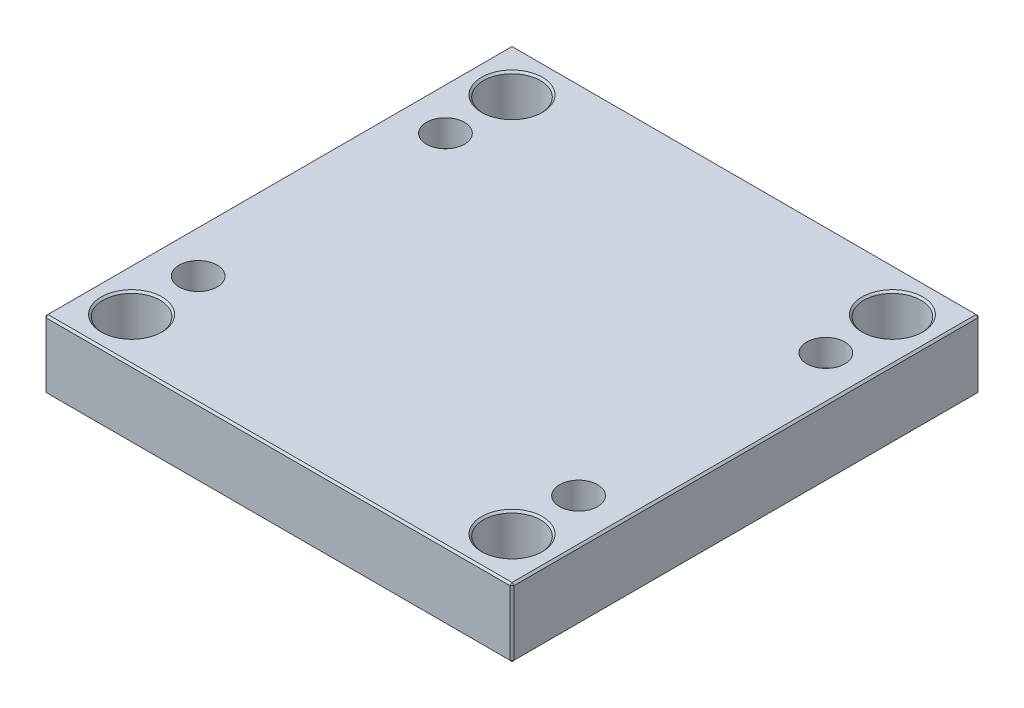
ISO-10303-21;
HEADER;
FILE_DESCRIPTION(('STEP AP214'),'2;1');
FILE_NAME('part.step','',(''),(''),'','','');
FILE_SCHEMA(('AUTOMOTIVE_DESIGN { 1 0 10303 214 1 1 1 1 }'));
ENDSEC;
DATA;
#1=APPLICATION_CONTEXT('core data for automotive mechanical design processes');
#2=APPLICATION_PROTOCOL_DEFINITION('international standard','automotive_design',2000,#1);
#3=PRODUCT_CONTEXT('',#1,'mechanical');
#4=PRODUCT('Part','Part','',(#3));
#5=PRODUCT_RELATED_PRODUCT_CATEGORY('part','',(#4));
#6=PRODUCT_DEFINITION_FORMATION('','',#4);
#7=PRODUCT_DEFINITION_CONTEXT('part definition',#1,'design');
#8=PRODUCT_DEFINITION('design','',#6,#7);
#9=PRODUCT_DEFINITION_SHAPE('','',#8);
#10=(LENGTH_UNIT() NAMED_UNIT(*) SI_UNIT(.MILLI.,.METRE.));
#11=(NAMED_UNIT(*) PLANE_ANGLE_UNIT() SI_UNIT($,.RADIAN.));
#12=(NAMED_UNIT(*) SI_UNIT($,.STERADIAN.) SOLID_ANGLE_UNIT());
#13=UNCERTAINTY_MEASURE_WITH_UNIT(LENGTH_MEASURE(1.E-05),#10,'distance_accuracy_value','');
#14=(GEOMETRIC_REPRESENTATION_CONTEXT(3) GLOBAL_UNCERTAINTY_ASSIGNED_CONTEXT((#13)) GLOBAL_UNIT_ASSIGNED_CONTEXT((#10,
#11,#12)) REPRESENTATION_CONTEXT('',''));
#15=CARTESIAN_POINT('',(0.,0.,0.));
#16=DIRECTION('',(0.,0.,1.));
#17=DIRECTION('',(1.,0.,0.));
#18=AXIS2_PLACEMENT_3D('',#15,#16,#17);
#19=CARTESIAN_POINT('',(-100.,0.,-65.));
#20=DIRECTION('',(0.,1.,0.));
#21=DIRECTION('',(0.,0.,1.));
#22=AXIS2_PLACEMENT_3D('',#19,#20,#21);
#23=CYLINDRICAL_SURFACE('',#22,6.);
#24=CARTESIAN_POINT('',(-100.,0.,-65.));
#25=DIRECTION('',(0.,1.,0.));
#26=DIRECTION('',(0.,0.,1.));
#27=AXIS2_PLACEMENT_3D('',#24,#25,#26);
#28=CIRCLE('',#27,6.);
#29=CARTESIAN_POINT('',(-100.,0.,-59.));
#30=VERTEX_POINT('',#29);
#31=EDGE_CURVE('E150',#30,#30,#28,.T.);
#32=ORIENTED_EDGE('',*,*,#31,.F.);
#33=EDGE_LOOP('',(#32));
#34=FACE_BOUND('',#33,.T.);
#35=CARTESIAN_POINT('',(-100.,22.,-65.));
#36=DIRECTION('',(0.,1.,0.));
#37=DIRECTION('',(0.,0.,1.));
#38=AXIS2_PLACEMENT_3D('',#35,#36,#37);
#39=CIRCLE('',#38,6.);
#40=CARTESIAN_POINT('',(-100.,22.,-59.));
#41=VERTEX_POINT('',#40);
#42=EDGE_CURVE('E20',#41,#41,#39,.F.);
#43=ORIENTED_EDGE('',*,*,#42,.F.);
#44=EDGE_LOOP('',(#43));
#45=FACE_BOUND('',#44,.T.);
#46=ADVANCED_FACE('F16',(#34,#45),#23,.F.);
#47=CARTESIAN_POINT('',(100.,0.,-65.));
#48=DIRECTION('',(0.,1.,0.));
#49=DIRECTION('',(0.,0.,1.));
#50=AXIS2_PLACEMENT_3D('',#47,#48,#49);
#51=CYLINDRICAL_SURFACE('',#50,6.);
#52=CARTESIAN_POINT('',(100.,0.,-65.));
#53=DIRECTION('',(0.,1.,0.));
#54=DIRECTION('',(0.,0.,1.));
#55=AXIS2_PLACEMENT_3D('',#52,#53,#54);
#56=CIRCLE('',#55,6.);
#57=CARTESIAN_POINT('',(100.,0.,-59.));
#58=VERTEX_POINT('',#57);
#59=EDGE_CURVE('E307',#58,#58,#56,.T.);
#60=ORIENTED_EDGE('',*,*,#59,.F.);
#61=EDGE_LOOP('',(#60));
#62=FACE_BOUND('',#61,.T.);
#63=CARTESIAN_POINT('',(100.,22.,-65.));
#64=DIRECTION('',(0.,1.,0.));
#65=DIRECTION('',(0.,0.,1.));
#66=AXIS2_PLACEMENT_3D('',#63,#64,#65);
#67=CIRCLE('',#66,6.);
#68=CARTESIAN_POINT('',(100.,22.,-59.));
#69=VERTEX_POINT('',#68);
#70=EDGE_CURVE('E294',#69,#69,#67,.F.);
#71=ORIENTED_EDGE('',*,*,#70,.F.);
#72=EDGE_LOOP('',(#71));
#73=FACE_BOUND('',#72,.T.);
#74=ADVANCED_FACE('F473',(#62,#73),#51,.F.);
#75=CARTESIAN_POINT('',(100.,0.,65.));
#76=DIRECTION('',(0.,1.,0.));
#77=DIRECTION('',(0.,0.,1.));
#78=AXIS2_PLACEMENT_3D('',#75,#76,#77);
#79=CYLINDRICAL_SURFACE('',#78,6.);
#80=CARTESIAN_POINT('',(100.,0.,65.));
#81=DIRECTION('',(0.,1.,0.));
#82=DIRECTION('',(0.,0.,1.));
#83=AXIS2_PLACEMENT_3D('',#80,#81,#82);
#84=CIRCLE('',#83,6.);
#85=CARTESIAN_POINT('',(100.,0.,71.));
#86=VERTEX_POINT('',#85);
#87=EDGE_CURVE('E303',#86,#86,#84,.T.);
#88=ORIENTED_EDGE('',*,*,#87,.F.);
#89=EDGE_LOOP('',(#88));
#90=FACE_BOUND('',#89,.T.);
#91=CARTESIAN_POINT('',(100.,22.,65.));
#92=DIRECTION('',(0.,1.,0.));
#93=DIRECTION('',(0.,0.,1.));
#94=AXIS2_PLACEMENT_3D('',#91,#92,#93);
#95=CIRCLE('',#94,6.);
#96=CARTESIAN_POINT('',(100.,22.,71.));
#97=VERTEX_POINT('',#96);
#98=EDGE_CURVE('E291',#97,#97,#95,.F.);
#99=ORIENTED_EDGE('',*,*,#98,.F.);
#100=EDGE_LOOP('',(#99));
#101=FACE_BOUND('',#100,.T.);
#102=ADVANCED_FACE('F480',(#90,#101),#79,.F.);
#103=CARTESIAN_POINT('',(-100.,0.,65.));
#104=DIRECTION('',(0.,1.,0.));
#105=DIRECTION('',(0.,0.,1.));
#106=AXIS2_PLACEMENT_3D('',#103,#104,#105);
#107=CYLINDRICAL_SURFACE('',#106,6.);
#108=CARTESIAN_POINT('',(-100.,0.,65.));
#109=DIRECTION('',(0.,1.,0.));
#110=DIRECTION('',(0.,0.,1.));
#111=AXIS2_PLACEMENT_3D('',#108,#109,#110);
#112=CIRCLE('',#111,6.);
#113=CARTESIAN_POINT('',(-100.,0.,71.));
#114=VERTEX_POINT('',#113);
#115=EDGE_CURVE('E299',#114,#114,#112,.T.);
#116=ORIENTED_EDGE('',*,*,#115,.F.);
#117=EDGE_LOOP('',(#116));
#118=FACE_BOUND('',#117,.T.);
#119=CARTESIAN_POINT('',(-100.,22.,65.));
#120=DIRECTION('',(0.,1.,0.));
#121=DIRECTION('',(0.,0.,1.));
#122=AXIS2_PLACEMENT_3D('',#119,#120,#121);
#123=CIRCLE('',#122,6.);
#124=CARTESIAN_POINT('',(-100.,22.,71.));
#125=VERTEX_POINT('',#124);
#126=EDGE_CURVE('E288',#125,#125,#123,.F.);
#127=ORIENTED_EDGE('',*,*,#126,.F.);
#128=EDGE_LOOP('',(#127));
#129=FACE_BOUND('',#128,.T.);
#130=ADVANCED_FACE('F485',(#118,#129),#107,.F.);
#131=CARTESIAN_POINT('',(-123.,36.,123.));
#132=DIRECTION('',(1.,0.,0.));
#133=DIRECTION('',(0.,0.,-1.));
#134=AXIS2_PLACEMENT_3D('',#131,#132,#133);
#135=PLANE('',#134);
#136=DIRECTION('',(0.,-1.,0.));
#137=VECTOR('',#136,1.);
#138=CARTESIAN_POINT('',(-123.,36.,-122.));
#139=LINE('',#138,#137);
#140=CARTESIAN_POINT('',(-123.,35.,-122.));
#141=VERTEX_POINT('',#140);
#142=CARTESIAN_POINT('',(-123.,1.,-122.));
#143=VERTEX_POINT('',#142);
#144=EDGE_CURVE('E118',#141,#143,#139,.T.);
#145=ORIENTED_EDGE('',*,*,#144,.T.);
#146=DIRECTION('',(0.,0.,1.));
#147=VECTOR('',#146,1.);
#148=CARTESIAN_POINT('',(-123.,1.,123.));
#149=LINE('',#148,#147);
#150=CARTESIAN_POINT('',(-123.,1.,122.));
#151=VERTEX_POINT('',#150);
#152=EDGE_CURVE('E114',#143,#151,#149,.T.);
#153=ORIENTED_EDGE('',*,*,#152,.T.);
#154=DIRECTION('',(0.,1.,0.));
#155=VECTOR('',#154,1.);
#156=CARTESIAN_POINT('',(-123.,36.,122.));
#157=LINE('',#156,#155);
#158=CARTESIAN_POINT('',(-123.,35.,122.));
#159=VERTEX_POINT('',#158);
#160=EDGE_CURVE('E106',#151,#159,#157,.T.);
#161=ORIENTED_EDGE('',*,*,#160,.T.);
#162=DIRECTION('',(0.,0.,-1.));
#163=VECTOR('',#162,1.);
#164=CARTESIAN_POINT('',(-123.,35.,-123.));
#165=LINE('',#164,#163);
#166=EDGE_CURVE('E111',#159,#141,#165,.T.);
#167=ORIENTED_EDGE('',*,*,#166,.T.);
#168=EDGE_LOOP('',(#145,#153,#161,#167));
#169=FACE_BOUND('',#168,.T.);
#170=ADVANCED_FACE('F109',(#169),#135,.F.);
#171=CARTESIAN_POINT('',(123.,36.,123.));
#172=DIRECTION('',(0.,0.,-1.));
#173=DIRECTION('',(-1.,0.,0.));
#174=AXIS2_PLACEMENT_3D('',#171,#172,#173);
#175=PLANE('',#174);
#176=DIRECTION('',(-1.,0.,0.));
#177=VECTOR('',#176,1.);
#178=CARTESIAN_POINT('',(-123.,35.,123.));
#179=LINE('',#178,#177);
#180=CARTESIAN_POINT('',(122.,35.,123.));
#181=VERTEX_POINT('',#180);
#182=CARTESIAN_POINT('',(-122.,35.,123.));
#183=VERTEX_POINT('',#182);
#184=EDGE_CURVE('E173',#181,#183,#179,.T.);
#185=ORIENTED_EDGE('',*,*,#184,.T.);
#186=DIRECTION('',(0.,-1.,0.));
#187=VECTOR('',#186,1.);
#188=CARTESIAN_POINT('',(-122.,36.,123.));
#189=LINE('',#188,#187);
#190=CARTESIAN_POINT('',(-122.,1.,123.));
#191=VERTEX_POINT('',#190);
#192=EDGE_CURVE('E126',#183,#191,#189,.T.);
#193=ORIENTED_EDGE('',*,*,#192,.T.);
#194=DIRECTION('',(1.,0.,0.));
#195=VECTOR('',#194,1.);
#196=CARTESIAN_POINT('',(123.,1.,123.));
#197=LINE('',#196,#195);
#198=CARTESIAN_POINT('',(122.,1.,123.));
#199=VERTEX_POINT('',#198);
#200=EDGE_CURVE('E177',#191,#199,#197,.T.);
#201=ORIENTED_EDGE('',*,*,#200,.T.);
#202=DIRECTION('',(0.,1.,0.));
#203=VECTOR('',#202,1.);
#204=CARTESIAN_POINT('',(122.,36.,123.));
#205=LINE('',#204,#203);
#206=EDGE_CURVE('E175',#199,#181,#205,.T.);
#207=ORIENTED_EDGE('',*,*,#206,.T.);
#208=EDGE_LOOP('',(#185,#193,#201,#207));
#209=FACE_BOUND('',#208,.T.);
#210=ADVANCED_FACE('F438',(#209),#175,.F.);
#211=CARTESIAN_POINT('',(123.,36.,123.));
#212=DIRECTION('',(-1.,0.,0.));
#213=DIRECTION('',(0.,0.,1.));
#214=AXIS2_PLACEMENT_3D('',#211,#212,#213);
#215=PLANE('',#214);
#216=DIRECTION('',(0.,0.,-1.));
#217=VECTOR('',#216,1.);
#218=CARTESIAN_POINT('',(123.,1.,123.));
#219=LINE('',#218,#217);
#220=CARTESIAN_POINT('',(123.,1.,122.));
#221=VERTEX_POINT('',#220);
#222=CARTESIAN_POINT('',(123.,1.,-122.));
#223=VERTEX_POINT('',#222);
#224=EDGE_CURVE('E168',#221,#223,#219,.T.);
#225=ORIENTED_EDGE('',*,*,#224,.T.);
#226=DIRECTION('',(0.,1.,0.));
#227=VECTOR('',#226,1.);
#228=CARTESIAN_POINT('',(123.,36.,-122.));
#229=LINE('',#228,#227);
#230=CARTESIAN_POINT('',(123.,35.,-122.));
#231=VERTEX_POINT('',#230);
#232=EDGE_CURVE('E170',#223,#231,#229,.T.);
#233=ORIENTED_EDGE('',*,*,#232,.T.);
#234=DIRECTION('',(0.,0.,1.));
#235=VECTOR('',#234,1.);
#236=CARTESIAN_POINT('',(123.,35.,123.));
#237=LINE('',#236,#235);
#238=CARTESIAN_POINT('',(123.,35.,122.));
#239=VERTEX_POINT('',#238);
#240=EDGE_CURVE('E164',#231,#239,#237,.T.);
#241=ORIENTED_EDGE('',*,*,#240,.T.);
#242=DIRECTION('',(0.,-1.,0.));
#243=VECTOR('',#242,1.);
#244=CARTESIAN_POINT('',(123.,36.,122.));
#245=LINE('',#244,#243);
#246=EDGE_CURVE('E166',#239,#221,#245,.T.);
#247=ORIENTED_EDGE('',*,*,#246,.T.);
#248=EDGE_LOOP('',(#225,#233,#241,#247));
#249=FACE_BOUND('',#248,.T.);
#250=ADVANCED_FACE('F431',(#249),#215,.F.);
#251=CARTESIAN_POINT('',(123.,36.,-123.));
#252=DIRECTION('',(0.,0.,1.));
#253=DIRECTION('',(1.,0.,0.));
#254=AXIS2_PLACEMENT_3D('',#251,#252,#253);
#255=PLANE('',#254);
#256=DIRECTION('',(0.,-1.,0.));
#257=VECTOR('',#256,1.);
#258=CARTESIAN_POINT('',(122.,36.,-123.));
#259=LINE('',#258,#257);
#260=CARTESIAN_POINT('',(122.,35.,-123.));
#261=VERTEX_POINT('',#260);
#262=CARTESIAN_POINT('',(122.,1.,-123.));
#263=VERTEX_POINT('',#262);
#264=EDGE_CURVE('E157',#261,#263,#259,.T.);
#265=ORIENTED_EDGE('',*,*,#264,.T.);
#266=DIRECTION('',(-1.,0.,0.));
#267=VECTOR('',#266,1.);
#268=CARTESIAN_POINT('',(123.,1.,-123.));
#269=LINE('',#268,#267);
#270=CARTESIAN_POINT('',(-122.,1.,-123.));
#271=VERTEX_POINT('',#270);
#272=EDGE_CURVE('E162',#263,#271,#269,.T.);
#273=ORIENTED_EDGE('',*,*,#272,.T.);
#274=DIRECTION('',(0.,1.,0.));
#275=VECTOR('',#274,1.);
#276=CARTESIAN_POINT('',(-122.,36.,-123.));
#277=LINE('',#276,#275);
#278=CARTESIAN_POINT('',(-122.,35.,-123.));
#279=VERTEX_POINT('',#278);
#280=EDGE_CURVE('E159',#271,#279,#277,.T.);
#281=ORIENTED_EDGE('',*,*,#280,.T.);
#282=DIRECTION('',(1.,0.,0.));
#283=VECTOR('',#282,1.);
#284=CARTESIAN_POINT('',(123.,35.,-123.));
#285=LINE('',#284,#283);
#286=EDGE_CURVE('E155',#279,#261,#285,.T.);
#287=ORIENTED_EDGE('',*,*,#286,.T.);
#288=EDGE_LOOP('',(#265,#273,#281,#287));
#289=FACE_BOUND('',#288,.T.);
#290=ADVANCED_FACE('F349',(#289),#255,.F.);
#291=CARTESIAN_POINT('',(0.,36.,0.));
#292=DIRECTION('',(0.,1.,0.));
#293=DIRECTION('',(0.,0.,1.));
#294=AXIS2_PLACEMENT_3D('',#291,#292,#293);
#295=PLANE('',#294);
#296=CARTESIAN_POINT('',(-100.,36.,65.));
#297=DIRECTION('',(0.,1.,0.));
#298=DIRECTION('',(0.,0.,1.));
#299=AXIS2_PLACEMENT_3D('',#296,#297,#298);
#300=CIRCLE('',#299,10.);
#301=CARTESIAN_POINT('',(-100.,36.,75.));
#302=VERTEX_POINT('',#301);
#303=EDGE_CURVE('E318',#302,#302,#300,.T.);
#304=ORIENTED_EDGE('',*,*,#303,.F.);
#305=EDGE_LOOP('',(#304));
#306=FACE_BOUND('',#305,.T.);
#307=CARTESIAN_POINT('',(100.,36.,65.));
#308=DIRECTION('',(0.,1.,0.));
#309=DIRECTION('',(0.,0.,1.));
#310=AXIS2_PLACEMENT_3D('',#307,#308,#309);
#311=CIRCLE('',#310,10.);
#312=CARTESIAN_POINT('',(100.,36.,75.));
#313=VERTEX_POINT('',#312);
#314=EDGE_CURVE('E324',#313,#313,#311,.T.);
#315=ORIENTED_EDGE('',*,*,#314,.F.);
#316=EDGE_LOOP('',(#315));
#317=FACE_BOUND('',#316,.T.);
#318=CARTESIAN_POINT('',(100.,36.,-65.));
#319=DIRECTION('',(0.,1.,0.));
#320=DIRECTION('',(0.,0.,1.));
#321=AXIS2_PLACEMENT_3D('',#318,#319,#320);
#322=CIRCLE('',#321,10.);
#323=CARTESIAN_POINT('',(100.,36.,-55.));
#324=VERTEX_POINT('',#323);
#325=EDGE_CURVE('E330',#324,#324,#322,.T.);
#326=ORIENTED_EDGE('',*,*,#325,.F.);
#327=EDGE_LOOP('',(#326));
#328=FACE_BOUND('',#327,.T.);
#329=CARTESIAN_POINT('',(-100.,36.,-65.));
#330=DIRECTION('',(0.,1.,0.));
#331=DIRECTION('',(0.,0.,1.));
#332=AXIS2_PLACEMENT_3D('',#329,#330,#331);
#333=CIRCLE('',#332,10.);
#334=CARTESIAN_POINT('',(-100.,36.,-55.));
#335=VERTEX_POINT('',#334);
#336=EDGE_CURVE('E312',#335,#335,#333,.T.);
#337=ORIENTED_EDGE('',*,*,#336,.F.);
#338=EDGE_LOOP('',(#337));
#339=FACE_BOUND('',#338,.T.);
#340=CARTESIAN_POINT('',(-100.,36.,100.));
#341=DIRECTION('',(0.,1.,0.));
#342=DIRECTION('',(0.,0.,1.));
#343=AXIS2_PLACEMENT_3D('',#340,#341,#342);
#344=CIRCLE('',#343,16.);
#345=CARTESIAN_POINT('',(-100.,36.,116.));
#346=VERTEX_POINT('',#345);
#347=EDGE_CURVE('E259',#346,#346,#344,.F.);
#348=ORIENTED_EDGE('',*,*,#347,.T.);
#349=EDGE_LOOP('',(#348));
#350=FACE_BOUND('',#349,.T.);
#351=CARTESIAN_POINT('',(100.,36.,100.));
#352=DIRECTION('',(0.,1.,0.));
#353=DIRECTION('',(0.,0.,1.));
#354=AXIS2_PLACEMENT_3D('',#351,#352,#353);
#355=CIRCLE('',#354,16.);
#356=CARTESIAN_POINT('',(100.,36.,116.));
#357=VERTEX_POINT('',#356);
#358=EDGE_CURVE('E256',#357,#357,#355,.F.);
#359=ORIENTED_EDGE('',*,*,#358,.T.);
#360=EDGE_LOOP('',(#359));
#361=FACE_BOUND('',#360,.T.);
#362=CARTESIAN_POINT('',(100.,36.,-100.));
#363=DIRECTION('',(0.,1.,0.));
#364=DIRECTION('',(0.,0.,1.));
#365=AXIS2_PLACEMENT_3D('',#362,#363,#364);
#366=CIRCLE('',#365,16.);
#367=CARTESIAN_POINT('',(100.,36.,-84.));
#368=VERTEX_POINT('',#367);
#369=EDGE_CURVE('E253',#368,#368,#366,.F.);
#370=ORIENTED_EDGE('',*,*,#369,.T.);
#371=EDGE_LOOP('',(#370));
#372=FACE_BOUND('',#371,.T.);
#373=CARTESIAN_POINT('',(-100.,36.,-100.));
#374=DIRECTION('',(0.,1.,0.));
#375=DIRECTION('',(0.,0.,1.));
#376=AXIS2_PLACEMENT_3D('',#373,#374,#375);
#377=CIRCLE('',#376,16.);
#378=CARTESIAN_POINT('',(-100.,36.,-84.));
#379=VERTEX_POINT('',#378);
#380=EDGE_CURVE('E250',#379,#379,#377,.F.);
#381=ORIENTED_EDGE('',*,*,#380,.T.);
#382=EDGE_LOOP('',(#381));
#383=FACE_BOUND('',#382,.T.);
#384=DIRECTION('',(0.,0.,-1.));
#385=VECTOR('',#384,1.);
#386=CARTESIAN_POINT('',(122.,36.,-123.));
#387=LINE('',#386,#385);
#388=CARTESIAN_POINT('',(122.,36.,122.));
#389=VERTEX_POINT('',#388);
#390=CARTESIAN_POINT('',(122.,36.,-122.));
#391=VERTEX_POINT('',#390);
#392=EDGE_CURVE('E33',#389,#391,#387,.T.);
#393=ORIENTED_EDGE('',*,*,#392,.T.);
#394=DIRECTION('',(-1.,0.,0.));
#395=VECTOR('',#394,1.);
#396=CARTESIAN_POINT('',(-123.,36.,-122.));
#397=LINE('',#396,#395);
#398=CARTESIAN_POINT('',(-122.,36.,-122.));
#399=VERTEX_POINT('',#398);
#400=EDGE_CURVE('E193',#391,#399,#397,.T.);
#401=ORIENTED_EDGE('',*,*,#400,.T.);
#402=DIRECTION('',(0.,0.,1.));
#403=VECTOR('',#402,1.);
#404=CARTESIAN_POINT('',(-122.,36.,123.));
#405=LINE('',#404,#403);
#406=CARTESIAN_POINT('',(-122.,36.,122.));
#407=VERTEX_POINT('',#406);
#408=EDGE_CURVE('E189',#399,#407,#405,.T.);
#409=ORIENTED_EDGE('',*,*,#408,.T.);
#410=DIRECTION('',(1.,0.,0.));
#411=VECTOR('',#410,1.);
#412=CARTESIAN_POINT('',(123.,36.,122.));
#413=LINE('',#412,#411);
#414=EDGE_CURVE('E38',#407,#389,#413,.T.);
#415=ORIENTED_EDGE('',*,*,#414,.T.);
#416=EDGE_LOOP('',(#393,#401,#409,#415));
#417=FACE_BOUND('',#416,.T.);
#418=ADVANCED_FACE('F345',(#306,#317,#328,#339,#350,#361,#372,#383,#417),#295,.T.);
#419=CARTESIAN_POINT('',(0.,0.,0.));
#420=DIRECTION('',(0.,1.,0.));
#421=DIRECTION('',(0.,0.,1.));
#422=AXIS2_PLACEMENT_3D('',#419,#420,#421);
#423=PLANE('',#422);
#424=CARTESIAN_POINT('',(-100.,0.,100.));
#425=DIRECTION('',(0.,1.,0.));
#426=DIRECTION('',(0.,0.,1.));
#427=AXIS2_PLACEMENT_3D('',#424,#425,#426);
#428=CIRCLE('',#427,16.);
#429=CARTESIAN_POINT('',(-100.,0.,116.));
#430=VERTEX_POINT('',#429);
#431=EDGE_CURVE('E271',#430,#430,#428,.T.);
#432=ORIENTED_EDGE('',*,*,#431,.T.);
#433=EDGE_LOOP('',(#432));
#434=FACE_BOUND('',#433,.T.);
#435=CARTESIAN_POINT('',(100.,0.,100.));
#436=DIRECTION('',(0.,1.,0.));
#437=DIRECTION('',(0.,0.,1.));
#438=AXIS2_PLACEMENT_3D('',#435,#436,#437);
#439=CIRCLE('',#438,16.);
#440=CARTESIAN_POINT('',(100.,0.,116.));
#441=VERTEX_POINT('',#440);
#442=EDGE_CURVE('E268',#441,#441,#439,.T.);
#443=ORIENTED_EDGE('',*,*,#442,.T.);
#444=EDGE_LOOP('',(#443));
#445=FACE_BOUND('',#444,.T.);
#446=CARTESIAN_POINT('',(100.,0.,-100.));
#447=DIRECTION('',(0.,1.,0.));
#448=DIRECTION('',(0.,0.,1.));
#449=AXIS2_PLACEMENT_3D('',#446,#447,#448);
#450=CIRCLE('',#449,16.);
#451=CARTESIAN_POINT('',(100.,0.,-84.));
#452=VERTEX_POINT('',#451);
#453=EDGE_CURVE('E265',#452,#452,#450,.T.);
#454=ORIENTED_EDGE('',*,*,#453,.T.);
#455=EDGE_LOOP('',(#454));
#456=FACE_BOUND('',#455,.T.);
#457=CARTESIAN_POINT('',(-100.,0.,-100.));
#458=DIRECTION('',(0.,1.,0.));
#459=DIRECTION('',(0.,0.,1.));
#460=AXIS2_PLACEMENT_3D('',#457,#458,#459);
#461=CIRCLE('',#460,16.);
#462=CARTESIAN_POINT('',(-100.,0.,-84.));
#463=VERTEX_POINT('',#462);
#464=EDGE_CURVE('E262',#463,#463,#461,.T.);
#465=ORIENTED_EDGE('',*,*,#464,.T.);
#466=EDGE_LOOP('',(#465));
#467=FACE_BOUND('',#466,.T.);
#468=ORIENTED_EDGE('',*,*,#115,.T.);
#469=EDGE_LOOP('',(#468));
#470=FACE_BOUND('',#469,.T.);
#471=ORIENTED_EDGE('',*,*,#87,.T.);
#472=EDGE_LOOP('',(#471));
#473=FACE_BOUND('',#472,.T.);
#474=ORIENTED_EDGE('',*,*,#59,.T.);
#475=EDGE_LOOP('',(#474));
#476=FACE_BOUND('',#475,.T.);
#477=ORIENTED_EDGE('',*,*,#31,.T.);
#478=EDGE_LOOP('',(#477));
#479=FACE_BOUND('',#478,.T.);
#480=DIRECTION('',(0.,0.,1.));
#481=VECTOR('',#480,1.);
#482=CARTESIAN_POINT('',(122.,0.,0.));
#483=LINE('',#482,#481);
#484=CARTESIAN_POINT('',(122.,0.,-122.));
#485=VERTEX_POINT('',#484);
#486=CARTESIAN_POINT('',(122.,0.,122.));
#487=VERTEX_POINT('',#486);
#488=EDGE_CURVE('E180',#485,#487,#483,.T.);
#489=ORIENTED_EDGE('',*,*,#488,.T.);
#490=DIRECTION('',(-1.,0.,0.));
#491=VECTOR('',#490,1.);
#492=CARTESIAN_POINT('',(0.,0.,122.));
#493=LINE('',#492,#491);
#494=CARTESIAN_POINT('',(-122.,0.,122.));
#495=VERTEX_POINT('',#494);
#496=EDGE_CURVE('E186',#487,#495,#493,.T.);
#497=ORIENTED_EDGE('',*,*,#496,.T.);
#498=DIRECTION('',(0.,0.,-1.));
#499=VECTOR('',#498,1.);
#500=CARTESIAN_POINT('',(-122.,0.,0.));
#501=LINE('',#500,#499);
#502=CARTESIAN_POINT('',(-122.,0.,-122.));
#503=VERTEX_POINT('',#502);
#504=EDGE_CURVE('E184',#495,#503,#501,.T.);
#505=ORIENTED_EDGE('',*,*,#504,.T.);
#506=DIRECTION('',(1.,0.,0.));
#507=VECTOR('',#506,1.);
#508=CARTESIAN_POINT('',(0.,0.,-122.));
#509=LINE('',#508,#507);
#510=EDGE_CURVE('E182',#503,#485,#509,.T.);
#511=ORIENTED_EDGE('',*,*,#510,.T.);
#512=EDGE_LOOP('',(#489,#497,#505,#511));
#513=FACE_BOUND('',#512,.T.);
#514=ADVANCED_FACE('F348',(#434,#445,#456,#467,#470,#473,#476,#479,#513),#423,.F.);
#515=CARTESIAN_POINT('',(123.,36.,122.));
#516=DIRECTION('',(-0.707106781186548,0.,-0.707106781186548));
#517=DIRECTION('',(0.,-1.,0.));
#518=AXIS2_PLACEMENT_3D('',#515,#516,#517);
#519=PLANE('',#518);
#520=DIRECTION('',(-0.707106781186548,0.,0.707106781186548));
#521=VECTOR('',#520,1.);
#522=CARTESIAN_POINT('',(122.,35.,123.));
#523=LINE('',#522,#521);
#524=EDGE_CURVE('E144',#181,#239,#523,.F.);
#525=ORIENTED_EDGE('',*,*,#524,.F.);
#526=ORIENTED_EDGE('',*,*,#206,.F.);
#527=DIRECTION('',(0.707106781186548,0.,-0.707106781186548));
#528=VECTOR('',#527,1.);
#529=CARTESIAN_POINT('',(122.,1.,123.));
#530=LINE('',#529,#528);
#531=EDGE_CURVE('E147',#221,#199,#530,.F.);
#532=ORIENTED_EDGE('',*,*,#531,.F.);
#533=ORIENTED_EDGE('',*,*,#246,.F.);
#534=EDGE_LOOP('',(#525,#526,#532,#533));
#535=FACE_BOUND('',#534,.T.);
#536=ADVANCED_FACE('F382',(#535),#519,.F.);
#537=CARTESIAN_POINT('',(122.,35.,123.));
#538=DIRECTION('',(0.577350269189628,0.57735026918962,0.577350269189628));
#539=DIRECTION('',(0.707106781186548,0.,-0.707106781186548));
#540=AXIS2_PLACEMENT_3D('',#537,#538,#539);
#541=PLANE('',#540);
#542=DIRECTION('',(0.,-0.70710678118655,0.707106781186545));
#543=VECTOR('',#542,1.);
#544=CARTESIAN_POINT('',(122.,35.,123.));
#545=LINE('',#544,#543);
#546=EDGE_CURVE('E238',#181,#389,#545,.F.);
#547=ORIENTED_EDGE('',*,*,#546,.F.);
#548=ORIENTED_EDGE('',*,*,#524,.T.);
#549=DIRECTION('',(-0.707106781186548,0.707106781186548,0.));
#550=VECTOR('',#549,1.);
#551=CARTESIAN_POINT('',(122.5,35.5,122.));
#552=LINE('',#551,#550);
#553=EDGE_CURVE('E240',#389,#239,#552,.F.);
#554=ORIENTED_EDGE('',*,*,#553,.F.);
#555=EDGE_LOOP('',(#547,#548,#554));
#556=FACE_BOUND('',#555,.T.);
#557=ADVANCED_FACE('F444',(#556),#541,.T.);
#558=CARTESIAN_POINT('',(122.,1.,123.));
#559=DIRECTION('',(0.577350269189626,-0.577350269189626,0.577350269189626));
#560=DIRECTION('',(0.707106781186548,0.,-0.707106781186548));
#561=AXIS2_PLACEMENT_3D('',#558,#559,#560);
#562=PLANE('',#561);
#563=DIRECTION('',(-0.707106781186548,-0.707106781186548,0.));
#564=VECTOR('',#563,1.);
#565=CARTESIAN_POINT('',(122.5,0.5,122.));
#566=LINE('',#565,#564);
#567=EDGE_CURVE('E232',#221,#487,#566,.T.);
#568=ORIENTED_EDGE('',*,*,#567,.F.);
#569=ORIENTED_EDGE('',*,*,#531,.T.);
#570=DIRECTION('',(0.,0.70710678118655,0.707106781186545));
#571=VECTOR('',#570,1.);
#572=CARTESIAN_POINT('',(122.,1.,123.));
#573=LINE('',#572,#571);
#574=EDGE_CURVE('E235',#487,#199,#573,.T.);
#575=ORIENTED_EDGE('',*,*,#574,.F.);
#576=EDGE_LOOP('',(#568,#569,#575));
#577=FACE_BOUND('',#576,.T.);
#578=ADVANCED_FACE('F403',(#577),#562,.T.);
#579=CARTESIAN_POINT('',(122.,36.,0.));
#580=DIRECTION('',(0.707106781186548,0.707106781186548,0.));
#581=DIRECTION('',(0.,0.,1.));
#582=AXIS2_PLACEMENT_3D('',#579,#580,#581);
#583=PLANE('',#582);
#584=ORIENTED_EDGE('',*,*,#553,.T.);
#585=ORIENTED_EDGE('',*,*,#240,.F.);
#586=DIRECTION('',(0.707106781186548,-0.707106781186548,0.));
#587=VECTOR('',#586,1.);
#588=CARTESIAN_POINT('',(123.,35.,-122.));
#589=LINE('',#588,#587);
#590=EDGE_CURVE('E227',#391,#231,#589,.T.);
#591=ORIENTED_EDGE('',*,*,#590,.F.);
#592=ORIENTED_EDGE('',*,*,#392,.F.);
#593=EDGE_LOOP('',(#584,#585,#591,#592));
#594=FACE_BOUND('',#593,.T.);
#595=ADVANCED_FACE('F446',(#594),#583,.T.);
#596=CARTESIAN_POINT('',(0.,36.,122.));
#597=DIRECTION('',(0.,0.707106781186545,0.70710678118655));
#598=DIRECTION('',(-1.,0.,0.));
#599=AXIS2_PLACEMENT_3D('',#596,#597,#598);
#600=PLANE('',#599);
#601=ORIENTED_EDGE('',*,*,#546,.T.);
#602=ORIENTED_EDGE('',*,*,#414,.F.);
#603=DIRECTION('',(0.,0.70710678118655,-0.707106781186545));
#604=VECTOR('',#603,1.);
#605=CARTESIAN_POINT('',(-122.,35.5,122.5));
#606=LINE('',#605,#604);
#607=EDGE_CURVE('E130',#183,#407,#606,.T.);
#608=ORIENTED_EDGE('',*,*,#607,.F.);
#609=ORIENTED_EDGE('',*,*,#184,.F.);
#610=EDGE_LOOP('',(#601,#602,#608,#609));
#611=FACE_BOUND('',#610,.T.);
#612=ADVANCED_FACE('F441',(#611),#600,.T.);
#613=CARTESIAN_POINT('',(-122.,36.,123.));
#614=DIRECTION('',(0.707106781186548,0.,-0.707106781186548));
#615=DIRECTION('',(0.,-1.,0.));
#616=AXIS2_PLACEMENT_3D('',#613,#614,#615);
#617=PLANE('',#616);
#618=DIRECTION('',(0.707106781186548,0.,0.707106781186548));
#619=VECTOR('',#618,1.);
#620=CARTESIAN_POINT('',(-122.,1.,123.));
#621=LINE('',#620,#619);
#622=EDGE_CURVE('E131',#191,#151,#621,.F.);
#623=ORIENTED_EDGE('',*,*,#622,.F.);
#624=ORIENTED_EDGE('',*,*,#192,.F.);
#625=DIRECTION('',(-0.707106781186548,0.,-0.707106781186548));
#626=VECTOR('',#625,1.);
#627=CARTESIAN_POINT('',(-123.,35.,122.));
#628=LINE('',#627,#626);
#629=EDGE_CURVE('E122',#159,#183,#628,.F.);
#630=ORIENTED_EDGE('',*,*,#629,.F.);
#631=ORIENTED_EDGE('',*,*,#160,.F.);
#632=EDGE_LOOP('',(#623,#624,#630,#631));
#633=FACE_BOUND('',#632,.T.);
#634=ADVANCED_FACE('F124',(#633),#617,.F.);
#635=CARTESIAN_POINT('',(123.,1.,123.));
#636=DIRECTION('',(0.,0.707106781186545,-0.70710678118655));
#637=DIRECTION('',(1.,0.,0.));
#638=AXIS2_PLACEMENT_3D('',#635,#636,#637);
#639=PLANE('',#638);
#640=ORIENTED_EDGE('',*,*,#574,.T.);
#641=ORIENTED_EDGE('',*,*,#200,.F.);
#642=DIRECTION('',(0.,-0.70710678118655,-0.707106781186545));
#643=VECTOR('',#642,1.);
#644=CARTESIAN_POINT('',(-122.,1.,123.));
#645=LINE('',#644,#643);
#646=EDGE_CURVE('E223',#495,#191,#645,.F.);
#647=ORIENTED_EDGE('',*,*,#646,.F.);
#648=ORIENTED_EDGE('',*,*,#496,.F.);
#649=EDGE_LOOP('',(#640,#641,#647,#648));
#650=FACE_BOUND('',#649,.T.);
#651=ADVANCED_FACE('F408',(#650),#639,.F.);
#652=CARTESIAN_POINT('',(123.,1.,123.));
#653=DIRECTION('',(-0.707106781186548,0.707106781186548,0.));
#654=DIRECTION('',(0.,0.,-1.));
#655=AXIS2_PLACEMENT_3D('',#652,#653,#654);
#656=PLANE('',#655);
#657=ORIENTED_EDGE('',*,*,#567,.T.);
#658=ORIENTED_EDGE('',*,*,#488,.F.);
#659=DIRECTION('',(0.707106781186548,0.707106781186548,0.));
#660=VECTOR('',#659,1.);
#661=CARTESIAN_POINT('',(122.5,0.499999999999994,-122.));
#662=LINE('',#661,#660);
#663=EDGE_CURVE('E220',#223,#485,#662,.F.);
#664=ORIENTED_EDGE('',*,*,#663,.F.);
#665=ORIENTED_EDGE('',*,*,#224,.F.);
#666=EDGE_LOOP('',(#657,#658,#664,#665));
#667=FACE_BOUND('',#666,.T.);
#668=ADVANCED_FACE('F401',(#667),#656,.F.);
#669=CARTESIAN_POINT('',(122.,36.,-123.));
#670=DIRECTION('',(-0.707106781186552,0.,0.707106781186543));
#671=DIRECTION('',(0.,-1.,0.));
#672=AXIS2_PLACEMENT_3D('',#669,#670,#671);
#673=PLANE('',#672);
#674=DIRECTION('',(0.707106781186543,0.,0.707106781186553));
#675=VECTOR('',#674,1.);
#676=CARTESIAN_POINT('',(123.,35.,-122.));
#677=LINE('',#676,#675);
#678=EDGE_CURVE('E229',#231,#261,#677,.F.);
#679=ORIENTED_EDGE('',*,*,#678,.F.);
#680=ORIENTED_EDGE('',*,*,#232,.F.);
#681=DIRECTION('',(-0.707106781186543,0.,-0.707106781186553));
#682=VECTOR('',#681,1.);
#683=CARTESIAN_POINT('',(122.,1.,-123.));
#684=LINE('',#683,#682);
#685=EDGE_CURVE('E217',#263,#223,#684,.F.);
#686=ORIENTED_EDGE('',*,*,#685,.F.);
#687=ORIENTED_EDGE('',*,*,#264,.F.);
#688=EDGE_LOOP('',(#679,#680,#686,#687));
#689=FACE_BOUND('',#688,.T.);
#690=ADVANCED_FACE('F428',(#689),#673,.F.);
#691=CARTESIAN_POINT('',(123.,35.,-122.));
#692=DIRECTION('',(0.577350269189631,0.577350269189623,-0.577350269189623));
#693=DIRECTION('',(-0.707106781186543,0.,-0.707106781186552));
#694=AXIS2_PLACEMENT_3D('',#691,#692,#693);
#695=PLANE('',#694);
#696=ORIENTED_EDGE('',*,*,#590,.T.);
#697=ORIENTED_EDGE('',*,*,#678,.T.);
#698=DIRECTION('',(0.,0.707106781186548,0.707106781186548));
#699=VECTOR('',#698,1.);
#700=CARTESIAN_POINT('',(122.,35.5,-122.5));
#701=LINE('',#700,#699);
#702=EDGE_CURVE('E138',#391,#261,#701,.F.);
#703=ORIENTED_EDGE('',*,*,#702,.F.);
#704=EDGE_LOOP('',(#696,#697,#703));
#705=FACE_BOUND('',#704,.T.);
#706=ADVANCED_FACE('F450',(#705),#695,.T.);
#707=CARTESIAN_POINT('',(-123.,35.,122.));
#708=DIRECTION('',(-0.577350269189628,0.57735026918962,0.577350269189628));
#709=DIRECTION('',(0.707106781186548,0.,0.707106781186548));
#710=AXIS2_PLACEMENT_3D('',#707,#708,#709);
#711=PLANE('',#710);
#712=ORIENTED_EDGE('',*,*,#629,.T.);
#713=ORIENTED_EDGE('',*,*,#607,.T.);
#714=DIRECTION('',(-0.707106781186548,-0.707106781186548,0.));
#715=VECTOR('',#714,1.);
#716=CARTESIAN_POINT('',(-123.,35.,122.));
#717=LINE('',#716,#715);
#718=EDGE_CURVE('E134',#159,#407,#717,.F.);
#719=ORIENTED_EDGE('',*,*,#718,.F.);
#720=EDGE_LOOP('',(#712,#713,#719));
#721=FACE_BOUND('',#720,.T.);
#722=ADVANCED_FACE('F135',(#721),#711,.T.);
#723=CARTESIAN_POINT('',(-122.,1.,123.));
#724=DIRECTION('',(-0.577350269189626,-0.577350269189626,0.577350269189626));
#725=DIRECTION('',(0.707106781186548,0.,0.707106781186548));
#726=AXIS2_PLACEMENT_3D('',#723,#724,#725);
#727=PLANE('',#726);
#728=ORIENTED_EDGE('',*,*,#646,.T.);
#729=ORIENTED_EDGE('',*,*,#622,.T.);
#730=DIRECTION('',(-0.707106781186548,0.707106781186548,0.));
#731=VECTOR('',#730,1.);
#732=CARTESIAN_POINT('',(-122.5,0.5,122.));
#733=LINE('',#732,#731);
#734=EDGE_CURVE('E139',#495,#151,#733,.T.);
#735=ORIENTED_EDGE('',*,*,#734,.F.);
#736=EDGE_LOOP('',(#728,#729,#735));
#737=FACE_BOUND('',#736,.T.);
#738=ADVANCED_FACE('F411',(#737),#727,.T.);
#739=CARTESIAN_POINT('',(122.,1.,-123.));
#740=DIRECTION('',(0.577350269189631,-0.577350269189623,-0.577350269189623));
#741=DIRECTION('',(-0.707106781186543,0.,-0.707106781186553));
#742=AXIS2_PLACEMENT_3D('',#739,#740,#741);
#743=PLANE('',#742);
#744=ORIENTED_EDGE('',*,*,#685,.T.);
#745=ORIENTED_EDGE('',*,*,#663,.T.);
#746=DIRECTION('',(0.,-0.707106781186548,0.707106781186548));
#747=VECTOR('',#746,1.);
#748=CARTESIAN_POINT('',(122.,1.,-123.));
#749=LINE('',#748,#747);
#750=EDGE_CURVE('E210',#263,#485,#749,.T.);
#751=ORIENTED_EDGE('',*,*,#750,.F.);
#752=EDGE_LOOP('',(#744,#745,#751));
#753=FACE_BOUND('',#752,.T.);
#754=ADVANCED_FACE('F422',(#753),#743,.T.);
#755=CARTESIAN_POINT('',(0.,36.,-122.));
#756=DIRECTION('',(0.,0.707106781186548,-0.707106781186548));
#757=DIRECTION('',(1.,0.,0.));
#758=AXIS2_PLACEMENT_3D('',#755,#756,#757);
#759=PLANE('',#758);
#760=ORIENTED_EDGE('',*,*,#702,.T.);
#761=ORIENTED_EDGE('',*,*,#286,.F.);
#762=DIRECTION('',(0.,-0.707106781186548,-0.707106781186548));
#763=VECTOR('',#762,1.);
#764=CARTESIAN_POINT('',(-122.,35.,-123.));
#765=LINE('',#764,#763);
#766=EDGE_CURVE('E207',#399,#279,#765,.T.);
#767=ORIENTED_EDGE('',*,*,#766,.F.);
#768=ORIENTED_EDGE('',*,*,#400,.F.);
#769=EDGE_LOOP('',(#760,#761,#767,#768));
#770=FACE_BOUND('',#769,.T.);
#771=ADVANCED_FACE('F454',(#770),#759,.T.);
#772=CARTESIAN_POINT('',(-122.,36.,0.));
#773=DIRECTION('',(-0.707106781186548,0.707106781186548,0.));
#774=DIRECTION('',(0.,0.,-1.));
#775=AXIS2_PLACEMENT_3D('',#772,#773,#774);
#776=PLANE('',#775);
#777=ORIENTED_EDGE('',*,*,#718,.T.);
#778=ORIENTED_EDGE('',*,*,#408,.F.);
#779=DIRECTION('',(0.707106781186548,0.707106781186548,0.));
#780=VECTOR('',#779,1.);
#781=CARTESIAN_POINT('',(-122.5,35.5,-122.));
#782=LINE('',#781,#780);
#783=EDGE_CURVE('E142',#141,#399,#782,.T.);
#784=ORIENTED_EDGE('',*,*,#783,.F.);
#785=ORIENTED_EDGE('',*,*,#166,.F.);
#786=EDGE_LOOP('',(#777,#778,#784,#785));
#787=FACE_BOUND('',#786,.T.);
#788=ADVANCED_FACE('F141',(#787),#776,.T.);
#789=CARTESIAN_POINT('',(-123.,1.,123.));
#790=DIRECTION('',(0.707106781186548,0.707106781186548,0.));
#791=DIRECTION('',(0.,0.,1.));
#792=AXIS2_PLACEMENT_3D('',#789,#790,#791);
#793=PLANE('',#792);
#794=ORIENTED_EDGE('',*,*,#734,.T.);
#795=ORIENTED_EDGE('',*,*,#152,.F.);
#796=DIRECTION('',(0.707106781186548,-0.707106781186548,0.));
#797=VECTOR('',#796,1.);
#798=CARTESIAN_POINT('',(-123.,1.,-122.));
#799=LINE('',#798,#797);
#800=EDGE_CURVE('E203',#503,#143,#799,.F.);
#801=ORIENTED_EDGE('',*,*,#800,.F.);
#802=ORIENTED_EDGE('',*,*,#504,.F.);
#803=EDGE_LOOP('',(#794,#795,#801,#802));
#804=FACE_BOUND('',#803,.T.);
#805=ADVANCED_FACE('F413',(#804),#793,.F.);
#806=CARTESIAN_POINT('',(123.,1.,-123.));
#807=DIRECTION('',(0.,0.707106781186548,0.707106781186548));
#808=DIRECTION('',(-1.,0.,0.));
#809=AXIS2_PLACEMENT_3D('',#806,#807,#808);
#810=PLANE('',#809);
#811=ORIENTED_EDGE('',*,*,#750,.T.);
#812=ORIENTED_EDGE('',*,*,#510,.F.);
#813=DIRECTION('',(0.,0.707106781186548,-0.707106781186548));
#814=VECTOR('',#813,1.);
#815=CARTESIAN_POINT('',(-122.,0.5,-122.5));
#816=LINE('',#815,#814);
#817=EDGE_CURVE('E200',#271,#503,#816,.F.);
#818=ORIENTED_EDGE('',*,*,#817,.F.);
#819=ORIENTED_EDGE('',*,*,#272,.F.);
#820=EDGE_LOOP('',(#811,#812,#818,#819));
#821=FACE_BOUND('',#820,.T.);
#822=ADVANCED_FACE('F417',(#821),#810,.F.);
#823=CARTESIAN_POINT('',(-122.,35.,-123.));
#824=DIRECTION('',(-0.577350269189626,0.577350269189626,-0.577350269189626));
#825=DIRECTION('',(-0.707106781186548,0.,0.707106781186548));
#826=AXIS2_PLACEMENT_3D('',#823,#824,#825);
#827=PLANE('',#826);
#828=ORIENTED_EDGE('',*,*,#783,.T.);
#829=ORIENTED_EDGE('',*,*,#766,.T.);
#830=DIRECTION('',(0.707106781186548,0.,-0.707106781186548));
#831=VECTOR('',#830,1.);
#832=CARTESIAN_POINT('',(-122.,35.,-123.));
#833=LINE('',#832,#831);
#834=EDGE_CURVE('E198',#141,#279,#833,.T.);
#835=ORIENTED_EDGE('',*,*,#834,.F.);
#836=EDGE_LOOP('',(#828,#829,#835));
#837=FACE_BOUND('',#836,.T.);
#838=ADVANCED_FACE('F456',(#837),#827,.T.);
#839=CARTESIAN_POINT('',(-123.,1.,-122.));
#840=DIRECTION('',(-0.577350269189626,-0.577350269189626,-0.577350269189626));
#841=DIRECTION('',(-0.707106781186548,0.,0.707106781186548));
#842=AXIS2_PLACEMENT_3D('',#839,#840,#841);
#843=PLANE('',#842);
#844=ORIENTED_EDGE('',*,*,#817,.T.);
#845=ORIENTED_EDGE('',*,*,#800,.T.);
#846=DIRECTION('',(-0.707106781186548,0.,0.707106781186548));
#847=VECTOR('',#846,1.);
#848=CARTESIAN_POINT('',(-123.,1.,-122.));
#849=LINE('',#848,#847);
#850=EDGE_CURVE('E196',#271,#143,#849,.T.);
#851=ORIENTED_EDGE('',*,*,#850,.F.);
#852=EDGE_LOOP('',(#844,#845,#851));
#853=FACE_BOUND('',#852,.T.);
#854=ADVANCED_FACE('F461',(#853),#843,.T.);
#855=CARTESIAN_POINT('',(-123.,36.,-122.));
#856=DIRECTION('',(0.707106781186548,0.,0.707106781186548));
#857=DIRECTION('',(0.,-1.,0.));
#858=AXIS2_PLACEMENT_3D('',#855,#856,#857);
#859=PLANE('',#858);
#860=ORIENTED_EDGE('',*,*,#834,.T.);
#861=ORIENTED_EDGE('',*,*,#280,.F.);
#862=ORIENTED_EDGE('',*,*,#850,.T.);
#863=ORIENTED_EDGE('',*,*,#144,.F.);
#864=EDGE_LOOP('',(#860,#861,#862,#863));
#865=FACE_BOUND('',#864,.T.);
#866=ADVANCED_FACE('F372',(#865),#859,.F.);
#867=CARTESIAN_POINT('',(-100.,0.,-100.));
#868=DIRECTION('',(0.,1.,0.));
#869=DIRECTION('',(0.,0.,1.));
#870=AXIS2_PLACEMENT_3D('',#867,#868,#869);
#871=CYLINDRICAL_SURFACE('',#870,15.);
#872=CARTESIAN_POINT('',(-100.,35.,-100.));
#873=DIRECTION('',(0.,1.,0.));
#874=DIRECTION('',(0.,0.,1.));
#875=AXIS2_PLACEMENT_3D('',#872,#873,#874);
#876=CIRCLE('',#875,15.);
#877=CARTESIAN_POINT('',(-100.,35.,-85.));
#878=VERTEX_POINT('',#877);
#879=EDGE_CURVE('E10',#878,#878,#876,.T.);
#880=ORIENTED_EDGE('',*,*,#879,.T.);
#881=EDGE_LOOP('',(#880));
#882=FACE_BOUND('',#881,.T.);
#883=CARTESIAN_POINT('',(-100.,1.,-100.));
#884=DIRECTION('',(0.,1.,0.));
#885=DIRECTION('',(0.,0.,1.));
#886=AXIS2_PLACEMENT_3D('',#883,#884,#885);
#887=CIRCLE('',#886,15.);
#888=CARTESIAN_POINT('',(-100.,1.,-85.));
#889=VERTEX_POINT('',#888);
#890=EDGE_CURVE('E25',#889,#889,#887,.F.);
#891=ORIENTED_EDGE('',*,*,#890,.T.);
#892=EDGE_LOOP('',(#891));
#893=FACE_BOUND('',#892,.T.);
#894=ADVANCED_FACE('F368',(#882,#893),#871,.F.);
#895=CARTESIAN_POINT('',(100.,0.,-100.));
#896=DIRECTION('',(0.,1.,0.));
#897=DIRECTION('',(0.,0.,1.));
#898=AXIS2_PLACEMENT_3D('',#895,#896,#897);
#899=CYLINDRICAL_SURFACE('',#898,15.);
#900=CARTESIAN_POINT('',(100.,35.,-100.));
#901=DIRECTION('',(0.,1.,0.));
#902=DIRECTION('',(0.,0.,1.));
#903=AXIS2_PLACEMENT_3D('',#900,#901,#902);
#904=CIRCLE('',#903,15.);
#905=CARTESIAN_POINT('',(100.,35.,-85.));
#906=VERTEX_POINT('',#905);
#907=EDGE_CURVE('E283',#906,#906,#904,.T.);
#908=ORIENTED_EDGE('',*,*,#907,.T.);
#909=EDGE_LOOP('',(#908));
#910=FACE_BOUND('',#909,.T.);
#911=CARTESIAN_POINT('',(100.,1.,-100.));
#912=DIRECTION('',(0.,1.,0.));
#913=DIRECTION('',(0.,0.,1.));
#914=AXIS2_PLACEMENT_3D('',#911,#912,#913);
#915=CIRCLE('',#914,15.);
#916=CARTESIAN_POINT('',(100.,1.,-85.));
#917=VERTEX_POINT('',#916);
#918=EDGE_CURVE('E280',#917,#917,#915,.F.);
#919=ORIENTED_EDGE('',*,*,#918,.T.);
#920=EDGE_LOOP('',(#919));
#921=FACE_BOUND('',#920,.T.);
#922=ADVANCED_FACE('F371',(#910,#921),#899,.F.);
#923=CARTESIAN_POINT('',(100.,0.,100.));
#924=DIRECTION('',(0.,1.,0.));
#925=DIRECTION('',(0.,0.,1.));
#926=AXIS2_PLACEMENT_3D('',#923,#924,#925);
#927=CYLINDRICAL_SURFACE('',#926,15.);
#928=CARTESIAN_POINT('',(100.,35.,100.));
#929=DIRECTION('',(0.,1.,0.));
#930=DIRECTION('',(0.,0.,1.));
#931=AXIS2_PLACEMENT_3D('',#928,#929,#930);
#932=CIRCLE('',#931,15.);
#933=CARTESIAN_POINT('',(100.,35.,115.));
#934=VERTEX_POINT('',#933);
#935=EDGE_CURVE('E277',#934,#934,#932,.T.);
#936=ORIENTED_EDGE('',*,*,#935,.T.);
#937=EDGE_LOOP('',(#936));
#938=FACE_BOUND('',#937,.T.);
#939=CARTESIAN_POINT('',(100.,1.00000000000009,100.));
#940=DIRECTION('',(0.,1.,0.));
#941=DIRECTION('',(0.,0.,1.));
#942=AXIS2_PLACEMENT_3D('',#939,#940,#941);
#943=CIRCLE('',#942,15.);
#944=CARTESIAN_POINT('',(100.,1.00000000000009,115.));
#945=VERTEX_POINT('',#944);
#946=EDGE_CURVE('E274',#945,#945,#943,.F.);
#947=ORIENTED_EDGE('',*,*,#946,.T.);
#948=EDGE_LOOP('',(#947));
#949=FACE_BOUND('',#948,.T.);
#950=ADVANCED_FACE('F533',(#938,#949),#927,.F.);
#951=CARTESIAN_POINT('',(-100.,0.,100.));
#952=DIRECTION('',(0.,1.,0.));
#953=DIRECTION('',(0.,0.,1.));
#954=AXIS2_PLACEMENT_3D('',#951,#952,#953);
#955=CYLINDRICAL_SURFACE('',#954,15.);
#956=CARTESIAN_POINT('',(-100.,35.,100.));
#957=DIRECTION('',(0.,1.,0.));
#958=DIRECTION('',(0.,0.,1.));
#959=AXIS2_PLACEMENT_3D('',#956,#957,#958);
#960=CIRCLE('',#959,15.);
#961=CARTESIAN_POINT('',(-100.,35.,115.));
#962=VERTEX_POINT('',#961);
#963=EDGE_CURVE('E247',#962,#962,#960,.T.);
#964=ORIENTED_EDGE('',*,*,#963,.T.);
#965=EDGE_LOOP('',(#964));
#966=FACE_BOUND('',#965,.T.);
#967=CARTESIAN_POINT('',(-100.,1.,100.));
#968=DIRECTION('',(0.,1.,0.));
#969=DIRECTION('',(0.,0.,1.));
#970=AXIS2_PLACEMENT_3D('',#967,#968,#969);
#971=CIRCLE('',#970,15.);
#972=CARTESIAN_POINT('',(-100.,1.,115.));
#973=VERTEX_POINT('',#972);
#974=EDGE_CURVE('E195',#973,#973,#971,.F.);
#975=ORIENTED_EDGE('',*,*,#974,.T.);
#976=EDGE_LOOP('',(#975));
#977=FACE_BOUND('',#976,.T.);
#978=ADVANCED_FACE('F537',(#966,#977),#955,.F.);
#979=CARTESIAN_POINT('',(-100.,35.,100.));
#980=DIRECTION('',(0.,1.,0.));
#981=DIRECTION('',(0.,0.,1.));
#982=AXIS2_PLACEMENT_3D('',#979,#980,#981);
#983=CONICAL_SURFACE('',#982,15.,0.785398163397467);
#984=ORIENTED_EDGE('',*,*,#347,.F.);
#985=EDGE_LOOP('',(#984));
#986=FACE_BOUND('',#985,.T.);
#987=ORIENTED_EDGE('',*,*,#963,.F.);
#988=EDGE_LOOP('',(#987));
#989=FACE_BOUND('',#988,.T.);
#990=ADVANCED_FACE('F540',(#986,#989),#983,.F.);
#991=CARTESIAN_POINT('',(-100.,0.,100.));
#992=DIRECTION('',(0.,-1.,0.));
#993=DIRECTION('',(0.,0.,-1.));
#994=AXIS2_PLACEMENT_3D('',#991,#992,#993);
#995=CONICAL_SURFACE('',#994,16.,0.785398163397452);
#996=ORIENTED_EDGE('',*,*,#974,.F.);
#997=EDGE_LOOP('',(#996));
#998=FACE_BOUND('',#997,.T.);
#999=ORIENTED_EDGE('',*,*,#431,.F.);
#1000=EDGE_LOOP('',(#999));
#1001=FACE_BOUND('',#1000,.T.);
#1002=ADVANCED_FACE('F546',(#998,#1001),#995,.F.);
#1003=CARTESIAN_POINT('',(100.,35.,100.));
#1004=DIRECTION('',(0.,1.,0.));
#1005=DIRECTION('',(0.,0.,1.));
#1006=AXIS2_PLACEMENT_3D('',#1003,#1004,#1005);
#1007=CONICAL_SURFACE('',#1006,15.,0.785398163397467);
#1008=ORIENTED_EDGE('',*,*,#358,.F.);
#1009=EDGE_LOOP('',(#1008));
#1010=FACE_BOUND('',#1009,.T.);
#1011=ORIENTED_EDGE('',*,*,#935,.F.);
#1012=EDGE_LOOP('',(#1011));
#1013=FACE_BOUND('',#1012,.T.);
#1014=ADVANCED_FACE('F555',(#1010,#1013),#1007,.F.);
#1015=CARTESIAN_POINT('',(100.,0.,100.));
#1016=DIRECTION('',(0.,-1.,0.));
#1017=DIRECTION('',(0.,0.,-1.));
#1018=AXIS2_PLACEMENT_3D('',#1015,#1016,#1017);
#1019=CONICAL_SURFACE('',#1018,16.,0.785398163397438);
#1020=ORIENTED_EDGE('',*,*,#946,.F.);
#1021=EDGE_LOOP('',(#1020));
#1022=FACE_BOUND('',#1021,.T.);
#1023=ORIENTED_EDGE('',*,*,#442,.F.);
#1024=EDGE_LOOP('',(#1023));
#1025=FACE_BOUND('',#1024,.T.);
#1026=ADVANCED_FACE('F571',(#1022,#1025),#1019,.F.);
#1027=CARTESIAN_POINT('',(100.,35.,-100.));
#1028=DIRECTION('',(0.,1.,0.));
#1029=DIRECTION('',(0.,0.,1.));
#1030=AXIS2_PLACEMENT_3D('',#1027,#1028,#1029);
#1031=CONICAL_SURFACE('',#1030,15.,0.785398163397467);
#1032=ORIENTED_EDGE('',*,*,#369,.F.);
#1033=EDGE_LOOP('',(#1032));
#1034=FACE_BOUND('',#1033,.T.);
#1035=ORIENTED_EDGE('',*,*,#907,.F.);
#1036=EDGE_LOOP('',(#1035));
#1037=FACE_BOUND('',#1036,.T.);
#1038=ADVANCED_FACE('F564',(#1034,#1037),#1031,.F.);
#1039=CARTESIAN_POINT('',(100.,0.,-100.));
#1040=DIRECTION('',(0.,-1.,0.));
#1041=DIRECTION('',(0.,0.,-1.));
#1042=AXIS2_PLACEMENT_3D('',#1039,#1040,#1041);
#1043=CONICAL_SURFACE('',#1042,16.,0.785398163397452);
#1044=ORIENTED_EDGE('',*,*,#918,.F.);
#1045=EDGE_LOOP('',(#1044));
#1046=FACE_BOUND('',#1045,.T.);
#1047=ORIENTED_EDGE('',*,*,#453,.F.);
#1048=EDGE_LOOP('',(#1047));
#1049=FACE_BOUND('',#1048,.T.);
#1050=ADVANCED_FACE('F365',(#1046,#1049),#1043,.F.);
#1051=CARTESIAN_POINT('',(-100.,35.,-100.));
#1052=DIRECTION('',(0.,1.,0.));
#1053=DIRECTION('',(0.,0.,1.));
#1054=AXIS2_PLACEMENT_3D('',#1051,#1052,#1053);
#1055=CONICAL_SURFACE('',#1054,15.,0.785398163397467);
#1056=ORIENTED_EDGE('',*,*,#380,.F.);
#1057=EDGE_LOOP('',(#1056));
#1058=FACE_BOUND('',#1057,.T.);
#1059=ORIENTED_EDGE('',*,*,#879,.F.);
#1060=EDGE_LOOP('',(#1059));
#1061=FACE_BOUND('',#1060,.T.);
#1062=ADVANCED_FACE('F362',(#1058,#1061),#1055,.F.);
#1063=CARTESIAN_POINT('',(-100.,0.,-100.));
#1064=DIRECTION('',(0.,-1.,0.));
#1065=DIRECTION('',(0.,0.,-1.));
#1066=AXIS2_PLACEMENT_3D('',#1063,#1064,#1065);
#1067=CONICAL_SURFACE('',#1066,16.,0.785398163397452);
#1068=ORIENTED_EDGE('',*,*,#890,.F.);
#1069=EDGE_LOOP('',(#1068));
#1070=FACE_BOUND('',#1069,.T.);
#1071=ORIENTED_EDGE('',*,*,#464,.F.);
#1072=EDGE_LOOP('',(#1071));
#1073=FACE_BOUND('',#1072,.T.);
#1074=ADVANCED_FACE('F18',(#1070,#1073),#1067,.F.);
#1075=CARTESIAN_POINT('',(-100.,22.,65.));
#1076=DIRECTION('',(0.,1.,0.));
#1077=DIRECTION('',(0.,0.,1.));
#1078=AXIS2_PLACEMENT_3D('',#1075,#1076,#1077);
#1079=PLANE('',#1078);
#1080=CARTESIAN_POINT('',(-100.,22.,65.));
#1081=DIRECTION('',(0.,1.,0.));
#1082=DIRECTION('',(0.,0.,1.));
#1083=AXIS2_PLACEMENT_3D('',#1080,#1081,#1082);
#1084=CIRCLE('',#1083,10.);
#1085=CARTESIAN_POINT('',(-100.,22.,75.));
#1086=VERTEX_POINT('',#1085);
#1087=EDGE_CURVE('E321',#1086,#1086,#1084,.T.);
#1088=ORIENTED_EDGE('',*,*,#1087,.T.);
#1089=EDGE_LOOP('',(#1088));
#1090=FACE_BOUND('',#1089,.T.);
#1091=ORIENTED_EDGE('',*,*,#126,.T.);
#1092=EDGE_LOOP('',(#1091));
#1093=FACE_BOUND('',#1092,.T.);
#1094=ADVANCED_FACE('F378',(#1090,#1093),#1079,.T.);
#1095=CARTESIAN_POINT('',(-100.,22.,65.));
#1096=DIRECTION('',(0.,1.,0.));
#1097=DIRECTION('',(0.,0.,1.));
#1098=AXIS2_PLACEMENT_3D('',#1095,#1096,#1097);
#1099=CYLINDRICAL_SURFACE('',#1098,10.);
#1100=ORIENTED_EDGE('',*,*,#1087,.F.);
#1101=EDGE_LOOP('',(#1100));
#1102=FACE_BOUND('',#1101,.T.);
#1103=ORIENTED_EDGE('',*,*,#303,.T.);
#1104=EDGE_LOOP('',(#1103));
#1105=FACE_BOUND('',#1104,.T.);
#1106=ADVANCED_FACE('F510',(#1102,#1105),#1099,.F.);
#1107=CARTESIAN_POINT('',(100.,22.,65.));
#1108=DIRECTION('',(0.,1.,0.));
#1109=DIRECTION('',(0.,0.,1.));
#1110=AXIS2_PLACEMENT_3D('',#1107,#1108,#1109);
#1111=PLANE('',#1110);
#1112=CARTESIAN_POINT('',(100.,22.,65.));
#1113=DIRECTION('',(0.,1.,0.));
#1114=DIRECTION('',(0.,0.,1.));
#1115=AXIS2_PLACEMENT_3D('',#1112,#1113,#1114);
#1116=CIRCLE('',#1115,10.);
#1117=CARTESIAN_POINT('',(100.,22.,75.));
#1118=VERTEX_POINT('',#1117);
#1119=EDGE_CURVE('E327',#1118,#1118,#1116,.T.);
#1120=ORIENTED_EDGE('',*,*,#1119,.T.);
#1121=EDGE_LOOP('',(#1120));
#1122=FACE_BOUND('',#1121,.T.);
#1123=ORIENTED_EDGE('',*,*,#98,.T.);
#1124=EDGE_LOOP('',(#1123));
#1125=FACE_BOUND('',#1124,.T.);
#1126=ADVANCED_FACE('F517',(#1122,#1125),#1111,.T.);
#1127=CARTESIAN_POINT('',(100.,22.,65.));
#1128=DIRECTION('',(0.,1.,0.));
#1129=DIRECTION('',(0.,0.,1.));
#1130=AXIS2_PLACEMENT_3D('',#1127,#1128,#1129);
#1131=CYLINDRICAL_SURFACE('',#1130,10.);
#1132=ORIENTED_EDGE('',*,*,#1119,.F.);
#1133=EDGE_LOOP('',(#1132));
#1134=FACE_BOUND('',#1133,.T.);
#1135=ORIENTED_EDGE('',*,*,#314,.T.);
#1136=EDGE_LOOP('',(#1135));
#1137=FACE_BOUND('',#1136,.T.);
#1138=ADVANCED_FACE('F521',(#1134,#1137),#1131,.F.);
#1139=CARTESIAN_POINT('',(100.,22.,-65.));
#1140=DIRECTION('',(0.,1.,0.));
#1141=DIRECTION('',(0.,0.,1.));
#1142=AXIS2_PLACEMENT_3D('',#1139,#1140,#1141);
#1143=PLANE('',#1142);
#1144=CARTESIAN_POINT('',(100.,22.,-65.));
#1145=DIRECTION('',(0.,1.,0.));
#1146=DIRECTION('',(0.,0.,1.));
#1147=AXIS2_PLACEMENT_3D('',#1144,#1145,#1146);
#1148=CIRCLE('',#1147,10.);
#1149=CARTESIAN_POINT('',(100.,22.,-55.));
#1150=VERTEX_POINT('',#1149);
#1151=EDGE_CURVE('E315',#1150,#1150,#1148,.T.);
#1152=ORIENTED_EDGE('',*,*,#1151,.T.);
#1153=EDGE_LOOP('',(#1152));
#1154=FACE_BOUND('',#1153,.T.);
#1155=ORIENTED_EDGE('',*,*,#70,.T.);
#1156=EDGE_LOOP('',(#1155));
#1157=FACE_BOUND('',#1156,.T.);
#1158=ADVANCED_FACE('F336',(#1154,#1157),#1143,.T.);
#1159=CARTESIAN_POINT('',(100.,22.,-65.));
#1160=DIRECTION('',(0.,1.,0.));
#1161=DIRECTION('',(0.,0.,1.));
#1162=AXIS2_PLACEMENT_3D('',#1159,#1160,#1161);
#1163=CYLINDRICAL_SURFACE('',#1162,10.);
#1164=ORIENTED_EDGE('',*,*,#1151,.F.);
#1165=EDGE_LOOP('',(#1164));
#1166=FACE_BOUND('',#1165,.T.);
#1167=ORIENTED_EDGE('',*,*,#325,.T.);
#1168=EDGE_LOOP('',(#1167));
#1169=FACE_BOUND('',#1168,.T.);
#1170=ADVANCED_FACE('F338',(#1166,#1169),#1163,.F.);
#1171=CARTESIAN_POINT('',(-100.,22.,-65.));
#1172=DIRECTION('',(0.,1.,0.));
#1173=DIRECTION('',(0.,0.,1.));
#1174=AXIS2_PLACEMENT_3D('',#1171,#1172,#1173);
#1175=PLANE('',#1174);
#1176=CARTESIAN_POINT('',(-100.,22.,-65.));
#1177=DIRECTION('',(0.,1.,0.));
#1178=DIRECTION('',(0.,0.,1.));
#1179=AXIS2_PLACEMENT_3D('',#1176,#1177,#1178);
#1180=CIRCLE('',#1179,10.);
#1181=CARTESIAN_POINT('',(-100.,22.,-55.));
#1182=VERTEX_POINT('',#1181);
#1183=EDGE_CURVE('E292',#1182,#1182,#1180,.T.);
#1184=ORIENTED_EDGE('',*,*,#1183,.T.);
#1185=EDGE_LOOP('',(#1184));
#1186=FACE_BOUND('',#1185,.T.);
#1187=ORIENTED_EDGE('',*,*,#42,.T.);
#1188=EDGE_LOOP('',(#1187));
#1189=FACE_BOUND('',#1188,.T.);
#1190=ADVANCED_FACE('F341',(#1186,#1189),#1175,.T.);
#1191=CARTESIAN_POINT('',(-100.,22.,-65.));
#1192=DIRECTION('',(0.,1.,0.));
#1193=DIRECTION('',(0.,0.,1.));
#1194=AXIS2_PLACEMENT_3D('',#1191,#1192,#1193);
#1195=CYLINDRICAL_SURFACE('',#1194,10.);
#1196=ORIENTED_EDGE('',*,*,#1183,.F.);
#1197=EDGE_LOOP('',(#1196));
#1198=FACE_BOUND('',#1197,.T.);
#1199=ORIENTED_EDGE('',*,*,#336,.T.);
#1200=EDGE_LOOP('',(#1199));
#1201=FACE_BOUND('',#1200,.T.);
#1202=ADVANCED_FACE('F526',(#1198,#1201),#1195,.F.);
#1203=CLOSED_SHELL('',(#46,#74,#102,#130,#170,#210,#250,#290,#418,#514,#536,#557,#578,#595,#612,
#634,#651,#668,#690,#706,#722,#738,#754,#771,#788,#805,#822,#838,#854,#866,#894,#922,#950,#978,
#990,#1002,#1014,#1026,#1038,#1050,#1062,#1074,#1094,#1106,#1126,#1138,#1158,#1170,#1190,#1202));
#1204=MANIFOLD_SOLID_BREP('B1',#1203);
#1205=ADVANCED_BREP_SHAPE_REPRESENTATION('',(#18,#1204),#14);
#1206=SHAPE_DEFINITION_REPRESENTATION(#9,#1205);
ENDSEC;
END-ISO-10303-21;
